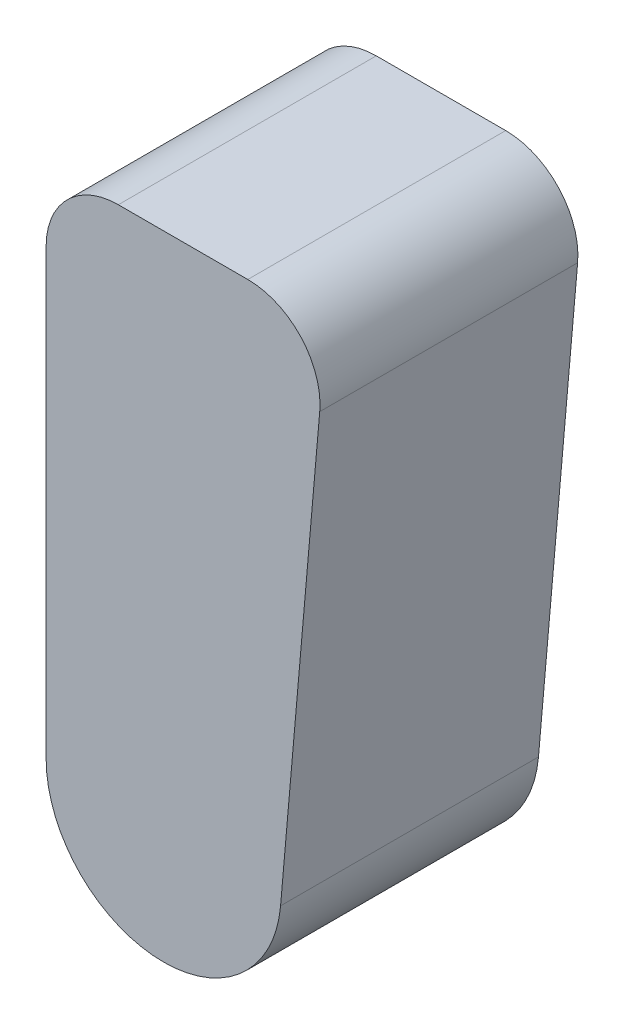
ISO-10303-21;
HEADER;
FILE_DESCRIPTION(('STEP AP214'),'2;1');
FILE_NAME('part.step','',(''),(''),'','','');
FILE_SCHEMA(('AUTOMOTIVE_DESIGN { 1 0 10303 214 1 1 1 1 }'));
ENDSEC;
DATA;
#1=APPLICATION_CONTEXT('core data for automotive mechanical design processes');
#2=APPLICATION_PROTOCOL_DEFINITION('international standard','automotive_design',2000,#1);
#3=PRODUCT_CONTEXT('',#1,'mechanical');
#4=PRODUCT('Part','Part','',(#3));
#5=PRODUCT_RELATED_PRODUCT_CATEGORY('part','',(#4));
#6=PRODUCT_DEFINITION_FORMATION('','',#4);
#7=PRODUCT_DEFINITION_CONTEXT('part definition',#1,'design');
#8=PRODUCT_DEFINITION('design','',#6,#7);
#9=PRODUCT_DEFINITION_SHAPE('','',#8);
#10=(LENGTH_UNIT() NAMED_UNIT(*) SI_UNIT(.MILLI.,.METRE.));
#11=(NAMED_UNIT(*) PLANE_ANGLE_UNIT() SI_UNIT($,.RADIAN.));
#12=(NAMED_UNIT(*) SI_UNIT($,.STERADIAN.) SOLID_ANGLE_UNIT());
#13=UNCERTAINTY_MEASURE_WITH_UNIT(LENGTH_MEASURE(1.E-05),#10,'distance_accuracy_value','');
#14=(GEOMETRIC_REPRESENTATION_CONTEXT(3) GLOBAL_UNCERTAINTY_ASSIGNED_CONTEXT((#13)) GLOBAL_UNIT_ASSIGNED_CONTEXT((#10,
#11,#12)) REPRESENTATION_CONTEXT('',''));
#15=CARTESIAN_POINT('',(0.,0.,0.));
#16=DIRECTION('',(0.,0.,1.));
#17=DIRECTION('',(1.,0.,0.));
#18=AXIS2_PLACEMENT_3D('',#15,#16,#17);
#19=CARTESIAN_POINT('',(-11.3846479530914,50.,25.));
#20=DIRECTION('',(1.,0.,0.));
#21=DIRECTION('',(0.,0.,-1.));
#22=AXIS2_PLACEMENT_3D('',#19,#20,#21);
#23=PLANE('',#22);
#24=DIRECTION('',(0.,-1.,0.));
#25=VECTOR('',#24,1.);
#26=CARTESIAN_POINT('',(-11.3846479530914,50.,25.));
#27=LINE('',#26,#25);
#28=CARTESIAN_POINT('',(-11.3846479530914,43.,25.));
#29=VERTEX_POINT('',#28);
#30=CARTESIAN_POINT('',(-11.3846479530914,0.,25.));
#31=VERTEX_POINT('',#30);
#32=EDGE_CURVE('E86',#29,#31,#27,.T.);
#33=ORIENTED_EDGE('',*,*,#32,.F.);
#34=DIRECTION('',(0.,0.,-1.));
#35=VECTOR('',#34,1.);
#36=CARTESIAN_POINT('',(-11.3846479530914,43.,25.));
#37=LINE('',#36,#35);
#38=CARTESIAN_POINT('',(-11.3846479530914,43.,0.));
#39=VERTEX_POINT('',#38);
#40=EDGE_CURVE('E11',#29,#39,#37,.T.);
#41=ORIENTED_EDGE('',*,*,#40,.T.);
#42=DIRECTION('',(0.,-1.,0.));
#43=VECTOR('',#42,1.);
#44=CARTESIAN_POINT('',(-11.3846479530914,50.,0.));
#45=LINE('',#44,#43);
#46=CARTESIAN_POINT('',(-11.3846479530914,0.,0.));
#47=VERTEX_POINT('',#46);
#48=EDGE_CURVE('E105',#39,#47,#45,.T.);
#49=ORIENTED_EDGE('',*,*,#48,.T.);
#50=DIRECTION('',(0.,0.,-1.));
#51=VECTOR('',#50,1.);
#52=CARTESIAN_POINT('',(-11.3846479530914,0.,25.));
#53=LINE('',#52,#51);
#54=EDGE_CURVE('E99',#31,#47,#53,.T.);
#55=ORIENTED_EDGE('',*,*,#54,.F.);
#56=EDGE_LOOP('',(#33,#41,#49,#55));
#57=FACE_BOUND('',#56,.T.);
#58=ADVANCED_FACE('F33',(#57),#23,.F.);
#59=CARTESIAN_POINT('',(0.,0.,25.));
#60=DIRECTION('',(0.,0.,-1.));
#61=DIRECTION('',(-1.,0.,0.));
#62=AXIS2_PLACEMENT_3D('',#59,#60,#61);
#63=CYLINDRICAL_SURFACE('',#62,11.3846479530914);
#64=CARTESIAN_POINT('',(0.,0.,0.));
#65=DIRECTION('',(0.,0.,1.));
#66=DIRECTION('',(-1.,0.,0.));
#67=AXIS2_PLACEMENT_3D('',#64,#65,#66);
#68=CIRCLE('',#67,11.3846479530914);
#69=CARTESIAN_POINT('',(11.3413259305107,-0.99223744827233,0.));
#70=VERTEX_POINT('',#69);
#71=EDGE_CURVE('E138',#47,#70,#68,.T.);
#72=ORIENTED_EDGE('',*,*,#71,.T.);
#73=DIRECTION('',(0.,0.,-1.));
#74=VECTOR('',#73,1.);
#75=CARTESIAN_POINT('',(11.3413259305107,-0.99223744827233,25.));
#76=LINE('',#75,#74);
#77=CARTESIAN_POINT('',(11.3413259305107,-0.99223744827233,25.));
#78=VERTEX_POINT('',#77);
#79=EDGE_CURVE('E101',#78,#70,#76,.T.);
#80=ORIENTED_EDGE('',*,*,#79,.F.);
#81=CARTESIAN_POINT('',(0.,0.,25.));
#82=DIRECTION('',(0.,0.,1.));
#83=DIRECTION('',(-1.,0.,0.));
#84=AXIS2_PLACEMENT_3D('',#81,#82,#83);
#85=CIRCLE('',#84,11.3846479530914);
#86=EDGE_CURVE('E89',#31,#78,#85,.T.);
#87=ORIENTED_EDGE('',*,*,#86,.F.);
#88=ORIENTED_EDGE('',*,*,#54,.T.);
#89=EDGE_LOOP('',(#72,#80,#87,#88));
#90=FACE_BOUND('',#89,.T.);
#91=ADVANCED_FACE('F98',(#90),#63,.T.);
#92=CARTESIAN_POINT('',(15.8025686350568,50.,25.));
#93=DIRECTION('',(-0.996194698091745,0.087155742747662,0.));
#94=DIRECTION('',(-0.087155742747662,-0.996194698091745,0.));
#95=AXIS2_PLACEMENT_3D('',#92,#93,#94);
#96=PLANE('',#95);
#97=DIRECTION('',(0.087155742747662,0.996194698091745,0.));
#98=VECTOR('',#97,1.);
#99=CARTESIAN_POINT('',(15.8025686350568,50.,0.));
#100=LINE('',#99,#98);
#101=CARTESIAN_POINT('',(15.1367720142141,42.3899098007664,0.));
#102=VERTEX_POINT('',#101);
#103=EDGE_CURVE('E136',#70,#102,#100,.T.);
#104=ORIENTED_EDGE('',*,*,#103,.T.);
#105=DIRECTION('',(0.,0.,-1.));
#106=VECTOR('',#105,1.);
#107=CARTESIAN_POINT('',(15.1367720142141,42.3899098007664,25.));
#108=LINE('',#107,#106);
#109=CARTESIAN_POINT('',(15.1367720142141,42.3899098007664,25.));
#110=VERTEX_POINT('',#109);
#111=EDGE_CURVE('E56',#102,#110,#108,.F.);
#112=ORIENTED_EDGE('',*,*,#111,.T.);
#113=DIRECTION('',(0.087155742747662,0.996194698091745,0.));
#114=VECTOR('',#113,1.);
#115=CARTESIAN_POINT('',(15.8025686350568,50.,25.));
#116=LINE('',#115,#114);
#117=EDGE_CURVE('E102',#78,#110,#116,.T.);
#118=ORIENTED_EDGE('',*,*,#117,.F.);
#119=ORIENTED_EDGE('',*,*,#79,.T.);
#120=EDGE_LOOP('',(#104,#112,#118,#119));
#121=FACE_BOUND('',#120,.T.);
#122=ADVANCED_FACE('F137',(#121),#96,.F.);
#123=CARTESIAN_POINT('',(-11.3846479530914,50.,25.));
#124=DIRECTION('',(0.,-1.,0.));
#125=DIRECTION('',(0.,0.,-1.));
#126=AXIS2_PLACEMENT_3D('',#123,#124,#125);
#127=PLANE('',#126);
#128=DIRECTION('',(-1.,0.,0.));
#129=VECTOR('',#128,1.);
#130=CARTESIAN_POINT('',(-11.3846479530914,50.,25.));
#131=LINE('',#130,#129);
#132=CARTESIAN_POINT('',(8.16340912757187,50.,25.));
#133=VERTEX_POINT('',#132);
#134=CARTESIAN_POINT('',(-4.3846479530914,50.,25.));
#135=VERTEX_POINT('',#134);
#136=EDGE_CURVE('E111',#133,#135,#131,.T.);
#137=ORIENTED_EDGE('',*,*,#136,.F.);
#138=DIRECTION('',(0.,0.,-1.));
#139=VECTOR('',#138,1.);
#140=CARTESIAN_POINT('',(8.16340912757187,50.,25.));
#141=LINE('',#140,#139);
#142=CARTESIAN_POINT('',(8.16340912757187,50.,0.));
#143=VERTEX_POINT('',#142);
#144=EDGE_CURVE('E109',#133,#143,#141,.T.);
#145=ORIENTED_EDGE('',*,*,#144,.T.);
#146=DIRECTION('',(-1.,0.,0.));
#147=VECTOR('',#146,1.);
#148=CARTESIAN_POINT('',(-11.3846479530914,50.,0.));
#149=LINE('',#148,#147);
#150=CARTESIAN_POINT('',(-4.3846479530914,50.,0.));
#151=VERTEX_POINT('',#150);
#152=EDGE_CURVE('E94',#143,#151,#149,.T.);
#153=ORIENTED_EDGE('',*,*,#152,.T.);
#154=DIRECTION('',(0.,0.,-1.));
#155=VECTOR('',#154,1.);
#156=CARTESIAN_POINT('',(-4.3846479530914,50.,25.));
#157=LINE('',#156,#155);
#158=EDGE_CURVE('E107',#151,#135,#157,.F.);
#159=ORIENTED_EDGE('',*,*,#158,.T.);
#160=EDGE_LOOP('',(#137,#145,#153,#159));
#161=FACE_BOUND('',#160,.T.);
#162=ADVANCED_FACE('F127',(#161),#127,.F.);
#163=CARTESIAN_POINT('',(0.,0.,25.));
#164=DIRECTION('',(0.,0.,-1.));
#165=DIRECTION('',(-1.,0.,0.));
#166=AXIS2_PLACEMENT_3D('',#163,#164,#165);
#167=PLANE('',#166);
#168=ORIENTED_EDGE('',*,*,#117,.T.);
#169=CARTESIAN_POINT('',(8.16340912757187,43.,25.));
#170=DIRECTION('',(0.,0.,-1.));
#171=DIRECTION('',(-1.,0.,0.));
#172=AXIS2_PLACEMENT_3D('',#169,#170,#171);
#173=CIRCLE('',#172,7.);
#174=EDGE_CURVE('E41',#110,#133,#173,.F.);
#175=ORIENTED_EDGE('',*,*,#174,.T.);
#176=ORIENTED_EDGE('',*,*,#136,.T.);
#177=CARTESIAN_POINT('',(-4.3846479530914,43.,25.));
#178=DIRECTION('',(0.,0.,-1.));
#179=DIRECTION('',(-1.,0.,0.));
#180=AXIS2_PLACEMENT_3D('',#177,#178,#179);
#181=CIRCLE('',#180,7.);
#182=EDGE_CURVE('E48',#135,#29,#181,.F.);
#183=ORIENTED_EDGE('',*,*,#182,.T.);
#184=ORIENTED_EDGE('',*,*,#32,.T.);
#185=ORIENTED_EDGE('',*,*,#86,.T.);
#186=EDGE_LOOP('',(#168,#175,#176,#183,#184,#185));
#187=FACE_BOUND('',#186,.T.);
#188=ADVANCED_FACE('F88',(#187),#167,.F.);
#189=CARTESIAN_POINT('',(0.,0.,0.));
#190=DIRECTION('',(0.,0.,-1.));
#191=DIRECTION('',(-1.,0.,0.));
#192=AXIS2_PLACEMENT_3D('',#189,#190,#191);
#193=PLANE('',#192);
#194=ORIENTED_EDGE('',*,*,#152,.F.);
#195=CARTESIAN_POINT('',(8.16340912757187,43.,0.));
#196=DIRECTION('',(0.,0.,-1.));
#197=DIRECTION('',(-1.,0.,0.));
#198=AXIS2_PLACEMENT_3D('',#195,#196,#197);
#199=CIRCLE('',#198,7.);
#200=EDGE_CURVE('E119',#143,#102,#199,.T.);
#201=ORIENTED_EDGE('',*,*,#200,.T.);
#202=ORIENTED_EDGE('',*,*,#103,.F.);
#203=ORIENTED_EDGE('',*,*,#71,.F.);
#204=ORIENTED_EDGE('',*,*,#48,.F.);
#205=CARTESIAN_POINT('',(-4.3846479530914,43.,0.));
#206=DIRECTION('',(0.,0.,-1.));
#207=DIRECTION('',(-1.,0.,0.));
#208=AXIS2_PLACEMENT_3D('',#205,#206,#207);
#209=CIRCLE('',#208,7.);
#210=EDGE_CURVE('E117',#39,#151,#209,.T.);
#211=ORIENTED_EDGE('',*,*,#210,.T.);
#212=EDGE_LOOP('',(#194,#201,#202,#203,#204,#211));
#213=FACE_BOUND('',#212,.T.);
#214=ADVANCED_FACE('F135',(#213),#193,.T.);
#215=CARTESIAN_POINT('',(8.16340912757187,43.,25.));
#216=DIRECTION('',(0.,0.,-1.));
#217=DIRECTION('',(-1.,0.,0.));
#218=AXIS2_PLACEMENT_3D('',#215,#216,#217);
#219=CYLINDRICAL_SURFACE('',#218,7.);
#220=ORIENTED_EDGE('',*,*,#174,.F.);
#221=ORIENTED_EDGE('',*,*,#111,.F.);
#222=ORIENTED_EDGE('',*,*,#200,.F.);
#223=ORIENTED_EDGE('',*,*,#144,.F.);
#224=EDGE_LOOP('',(#220,#221,#222,#223));
#225=FACE_BOUND('',#224,.T.);
#226=ADVANCED_FACE('F132',(#225),#219,.T.);
#227=CARTESIAN_POINT('',(-4.3846479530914,43.,25.));
#228=DIRECTION('',(0.,0.,-1.));
#229=DIRECTION('',(-1.,0.,0.));
#230=AXIS2_PLACEMENT_3D('',#227,#228,#229);
#231=CYLINDRICAL_SURFACE('',#230,7.);
#232=ORIENTED_EDGE('',*,*,#182,.F.);
#233=ORIENTED_EDGE('',*,*,#158,.F.);
#234=ORIENTED_EDGE('',*,*,#210,.F.);
#235=ORIENTED_EDGE('',*,*,#40,.F.);
#236=EDGE_LOOP('',(#232,#233,#234,#235));
#237=FACE_BOUND('',#236,.T.);
#238=ADVANCED_FACE('F35',(#237),#231,.T.);
#239=CLOSED_SHELL('',(#58,#91,#122,#162,#188,#214,#226,#238));
#240=MANIFOLD_SOLID_BREP('B2',#239);
#241=ADVANCED_BREP_SHAPE_REPRESENTATION('',(#18,#240),#14);
#242=SHAPE_DEFINITION_REPRESENTATION(#9,#241);
ENDSEC;
END-ISO-10303-21;
